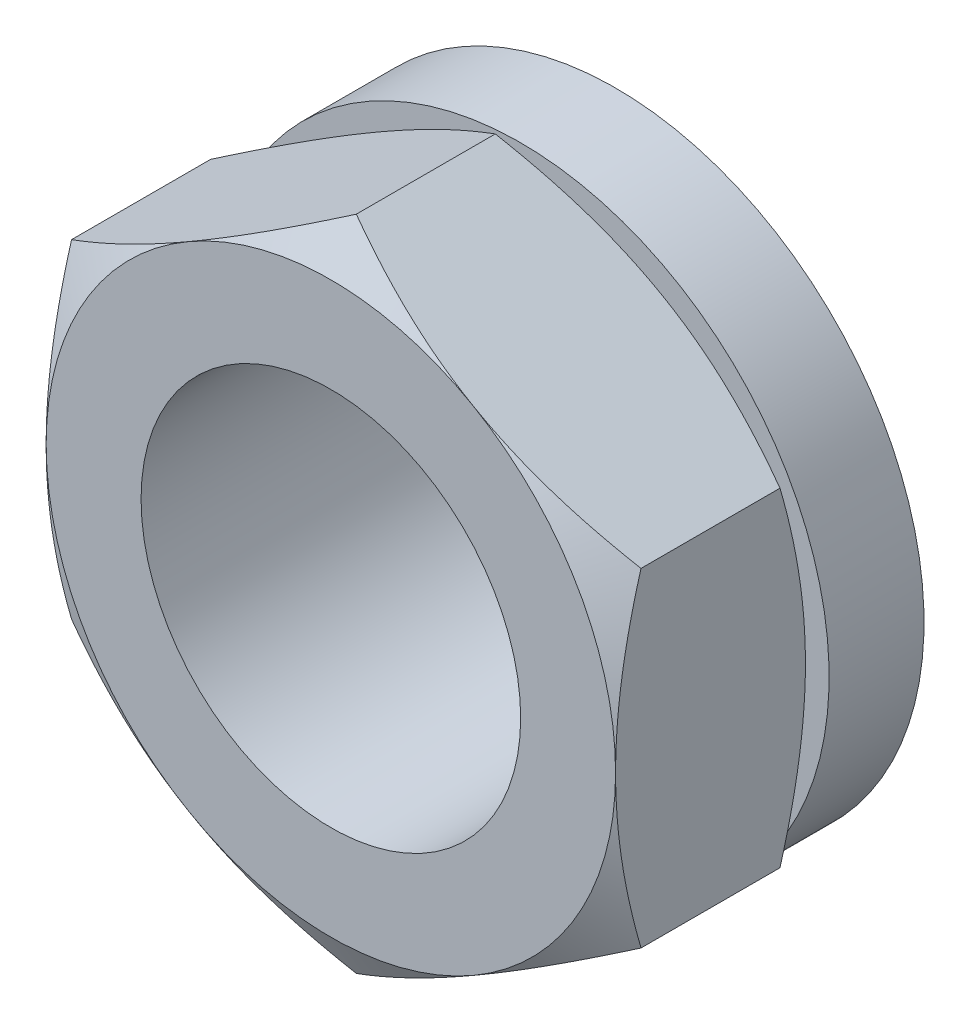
ISO-10303-21;
HEADER;
FILE_DESCRIPTION(('STEP AP214'),'2;1');
FILE_NAME('part.step','',(''),(''),'','','');
FILE_SCHEMA(('AUTOMOTIVE_DESIGN { 1 0 10303 214 1 1 1 1 }'));
ENDSEC;
DATA;
#1=APPLICATION_CONTEXT('core data for automotive mechanical design processes');
#2=APPLICATION_PROTOCOL_DEFINITION('international standard','automotive_design',2000,#1);
#3=PRODUCT_CONTEXT('',#1,'mechanical');
#4=PRODUCT('Part','Part','',(#3));
#5=PRODUCT_RELATED_PRODUCT_CATEGORY('part','',(#4));
#6=PRODUCT_DEFINITION_FORMATION('','',#4);
#7=PRODUCT_DEFINITION_CONTEXT('part definition',#1,'design');
#8=PRODUCT_DEFINITION('design','',#6,#7);
#9=PRODUCT_DEFINITION_SHAPE('','',#8);
#10=(LENGTH_UNIT() NAMED_UNIT(*) SI_UNIT(.MILLI.,.METRE.));
#11=(NAMED_UNIT(*) PLANE_ANGLE_UNIT() SI_UNIT($,.RADIAN.));
#12=(NAMED_UNIT(*) SI_UNIT($,.STERADIAN.) SOLID_ANGLE_UNIT());
#13=UNCERTAINTY_MEASURE_WITH_UNIT(LENGTH_MEASURE(1.E-05),#10,'distance_accuracy_value','');
#14=(GEOMETRIC_REPRESENTATION_CONTEXT(3) GLOBAL_UNCERTAINTY_ASSIGNED_CONTEXT((#13)) GLOBAL_UNIT_ASSIGNED_CONTEXT((#10,
#11,#12)) REPRESENTATION_CONTEXT('',''));
#15=CARTESIAN_POINT('',(0.,0.,0.));
#16=DIRECTION('',(0.,0.,1.));
#17=DIRECTION('',(1.,0.,0.));
#18=AXIS2_PLACEMENT_3D('',#15,#16,#17);
#19=CARTESIAN_POINT('',(0.,6.92820323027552,6.));
#20=DIRECTION('',(0.,0.,-1.));
#21=DIRECTION('',(-1.,0.,0.));
#22=AXIS2_PLACEMENT_3D('',#19,#20,#21);
#23=PLANE('',#22);
#24=CARTESIAN_POINT('',(0.,0.,6.));
#25=DIRECTION('',(0.,0.,1.));
#26=DIRECTION('',(1.,0.,0.));
#27=AXIS2_PLACEMENT_3D('',#24,#25,#26);
#28=CIRCLE('',#27,6.);
#29=CARTESIAN_POINT('',(-3.,5.19615242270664,6.));
#30=VERTEX_POINT('',#29);
#31=CARTESIAN_POINT('',(-6.,0.,6.));
#32=VERTEX_POINT('',#31);
#33=EDGE_CURVE('E326',#30,#32,#28,.T.);
#34=ORIENTED_EDGE('',*,*,#33,.T.);
#35=CARTESIAN_POINT('',(-3.,-5.19615242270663,6.));
#36=VERTEX_POINT('',#35);
#37=EDGE_CURVE('E327',#32,#36,#28,.T.);
#38=ORIENTED_EDGE('',*,*,#37,.T.);
#39=CARTESIAN_POINT('',(3.,-5.19615242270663,6.));
#40=VERTEX_POINT('',#39);
#41=EDGE_CURVE('E142',#36,#40,#28,.T.);
#42=ORIENTED_EDGE('',*,*,#41,.T.);
#43=CARTESIAN_POINT('',(6.,0.,6.));
#44=VERTEX_POINT('',#43);
#45=EDGE_CURVE('E140',#40,#44,#28,.T.);
#46=ORIENTED_EDGE('',*,*,#45,.T.);
#47=CARTESIAN_POINT('',(3.,5.19615242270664,6.));
#48=VERTEX_POINT('',#47);
#49=EDGE_CURVE('E144',#44,#48,#28,.T.);
#50=ORIENTED_EDGE('',*,*,#49,.T.);
#51=EDGE_CURVE('E320',#48,#30,#28,.T.);
#52=ORIENTED_EDGE('',*,*,#51,.T.);
#53=EDGE_LOOP('',(#34,#38,#42,#46,#50,#52));
#54=FACE_BOUND('',#53,.T.);
#55=CARTESIAN_POINT('',(0.,0.,6.));
#56=DIRECTION('',(0.,0.,-1.));
#57=DIRECTION('',(-1.,0.,0.));
#58=AXIS2_PLACEMENT_3D('',#55,#56,#57);
#59=CIRCLE('',#58,4.);
#60=CARTESIAN_POINT('',(-4.,0.,6.));
#61=VERTEX_POINT('',#60);
#62=EDGE_CURVE('E286',#61,#61,#59,.T.);
#63=ORIENTED_EDGE('',*,*,#62,.T.);
#64=EDGE_LOOP('',(#63));
#65=FACE_BOUND('',#64,.T.);
#66=ADVANCED_FACE('F14',(#54,#65),#23,.F.);
#67=CARTESIAN_POINT('',(-6.,3.46410161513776,2.));
#68=DIRECTION('',(0.5,-0.866025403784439,0.));
#69=DIRECTION('',(-0.866025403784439,-0.5,0.));
#70=AXIS2_PLACEMENT_3D('',#67,#68,#69);
#71=PLANE('',#70);
#72=DIRECTION('',(0.,0.,1.));
#73=VECTOR('',#72,1.);
#74=CARTESIAN_POINT('',(0.,6.92820323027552,2.));
#75=LINE('',#74,#73);
#76=CARTESIAN_POINT('',(0.,6.92820323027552,2.53589838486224));
#77=VERTEX_POINT('',#76);
#78=CARTESIAN_POINT('',(0.,6.92820323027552,5.46410161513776));
#79=VERTEX_POINT('',#78);
#80=EDGE_CURVE('E298',#77,#79,#75,.T.);
#81=ORIENTED_EDGE('',*,*,#80,.F.);
#82=CARTESIAN_POINT('',(0.000199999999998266,6.92831870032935,2.53596505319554));
#83=CARTESIAN_POINT('',(-0.131687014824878,6.85217369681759,2.49200899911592));
#84=CARTESIAN_POINT('',(-0.264065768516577,6.7757447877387,2.4500478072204));
#85=CARTESIAN_POINT('',(-0.529898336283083,6.62226628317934,2.37066457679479));
#86=CARTESIAN_POINT('',(-0.663352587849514,6.54521643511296,2.33324449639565));
#87=CARTESIAN_POINT('',(-1.06585213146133,6.31283321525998,2.22853041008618));
#88=CARTESIAN_POINT('',(-1.33648623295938,6.15658254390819,2.16897005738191));
#89=CARTESIAN_POINT('',(-1.74148524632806,5.92275625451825,2.09912821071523));
#90=CARTESIAN_POINT('',(-1.87464004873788,5.84587929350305,2.07923222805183));
#91=CARTESIAN_POINT('',(-2.14155132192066,5.69177799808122,2.04586941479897));
#92=CARTESIAN_POINT('',(-2.27530773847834,5.6145536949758,2.03240201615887));
#93=CARTESIAN_POINT('',(-2.54305288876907,5.45997096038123,2.01223959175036));
#94=CARTESIAN_POINT('',(-2.67704118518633,5.38261278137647,2.00553687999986));
#95=CARTESIAN_POINT('',(-2.94513416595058,5.22782922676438,1.99904036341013));
#96=CARTESIAN_POINT('',(-3.07923884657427,5.1504038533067,1.99924634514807));
#97=CARTESIAN_POINT('',(-3.44664501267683,4.93828180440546,2.00930718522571));
#98=CARTESIAN_POINT('',(-3.6798262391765,4.80365456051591,2.02619789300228));
#99=CARTESIAN_POINT('',(-4.14463991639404,4.53529425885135,2.07975922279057));
#100=CARTESIAN_POINT('',(-4.3762707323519,4.40156214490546,2.11644815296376));
#101=CARTESIAN_POINT('',(-4.84201989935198,4.13266173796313,2.2081601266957));
#102=CARTESIAN_POINT('',(-5.07607947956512,3.99752737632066,2.26357175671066));
#103=CARTESIAN_POINT('',(-5.54070808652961,3.72927392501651,2.38933391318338));
#104=CARTESIAN_POINT('',(-5.77128306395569,3.59615139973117,2.45965489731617));
#105=CARTESIAN_POINT('',(-6.0002,3.46398614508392,2.53596505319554));
#106=B_SPLINE_CURVE_WITH_KNOTS('',3,(#82,#83,#84,#85,#86,#87,#88,#89,#90,#91,#92,#93,#94,#95,
#96,#97,#98,#99,#100,#101,#102,#103,#104,#105),.UNSPECIFIED.,.F.,.F.,(4,2,2,2,2,2,2,2,2,2,2,4),
(0.,0.475482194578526,0.951168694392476,1.90451835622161,2.36951738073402,2.83447530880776,
3.29890435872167,3.76331906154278,4.57182194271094,5.38107376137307,6.20827406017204,
7.03385036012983),.UNSPECIFIED.);
#107=CARTESIAN_POINT('',(-3.,5.19615242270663,2.));
#108=VERTEX_POINT('',#107);
#109=EDGE_CURVE('E508',#77,#108,#106,.T.);
#110=ORIENTED_EDGE('',*,*,#109,.T.);
#111=CARTESIAN_POINT('',(-6.,3.46410161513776,2.53589838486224));
#112=VERTEX_POINT('',#111);
#113=EDGE_CURVE('E185',#108,#112,#106,.T.);
#114=ORIENTED_EDGE('',*,*,#113,.T.);
#115=DIRECTION('',(0.,0.,1.));
#116=VECTOR('',#115,1.);
#117=CARTESIAN_POINT('',(-6.,3.46410161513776,2.));
#118=LINE('',#117,#116);
#119=CARTESIAN_POINT('',(-6.,3.46410161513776,5.46410161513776));
#120=VERTEX_POINT('',#119);
#121=EDGE_CURVE('E279',#112,#120,#118,.T.);
#122=ORIENTED_EDGE('',*,*,#121,.T.);
#123=CARTESIAN_POINT('',(-6.0002,3.46398614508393,5.46403494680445));
#124=CARTESIAN_POINT('',(-5.86831298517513,3.54013114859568,5.50799100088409));
#125=CARTESIAN_POINT('',(-5.73593423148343,3.61656005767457,5.54995219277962));
#126=CARTESIAN_POINT('',(-5.47010166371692,3.77003856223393,5.62933542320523));
#127=CARTESIAN_POINT('',(-5.33664741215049,3.84708841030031,5.66675550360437));
#128=CARTESIAN_POINT('',(-4.93414786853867,4.07947163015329,5.77146958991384));
#129=CARTESIAN_POINT('',(-4.66351376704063,4.23572230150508,5.83102994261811));
#130=CARTESIAN_POINT('',(-4.25851475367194,4.46954859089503,5.90087178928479));
#131=CARTESIAN_POINT('',(-4.12535995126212,4.54642555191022,5.92076777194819));
#132=CARTESIAN_POINT('',(-3.85844867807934,4.70052684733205,5.95413058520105));
#133=CARTESIAN_POINT('',(-3.72469226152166,4.77775115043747,5.96759798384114));
#134=CARTESIAN_POINT('',(-3.45694711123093,4.93233388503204,5.98776040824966));
#135=CARTESIAN_POINT('',(-3.32295881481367,5.0096920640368,5.99446312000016));
#136=CARTESIAN_POINT('',(-3.05486583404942,5.16447561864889,6.00095963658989));
#137=CARTESIAN_POINT('',(-2.92076115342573,5.24190099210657,6.00075365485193));
#138=CARTESIAN_POINT('',(-2.55335498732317,5.45402304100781,5.99069281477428));
#139=CARTESIAN_POINT('',(-2.3201737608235,5.58865028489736,5.97380210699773));
#140=CARTESIAN_POINT('',(-1.85536008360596,5.85701058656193,5.92024077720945));
#141=CARTESIAN_POINT('',(-1.6237292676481,5.99074270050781,5.88355184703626));
#142=CARTESIAN_POINT('',(-1.15798010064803,6.25964310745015,5.79183987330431));
#143=CARTESIAN_POINT('',(-0.923920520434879,6.39477746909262,5.73642824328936));
#144=CARTESIAN_POINT('',(-0.459291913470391,6.66303092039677,5.61066608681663));
#145=CARTESIAN_POINT('',(-0.22871693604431,6.7961534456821,5.54034510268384));
#146=CARTESIAN_POINT('',(0.00019999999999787,6.92831870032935,5.46403494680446));
#147=B_SPLINE_CURVE_WITH_KNOTS('',3,(#123,#124,#125,#126,#127,#128,#129,#130,#131,#132,#133,
#134,#135,#136,#137,#138,#139,#140,#141,#142,#143,#144,#145,#146),.UNSPECIFIED.,.F.,.F.,(4,2,2,
2,2,2,2,2,2,2,2,4),(0.,0.475482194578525,0.951168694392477,1.90451835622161,2.36951738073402,
2.83447530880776,3.29890435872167,3.76331906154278,4.57182194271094,5.38107376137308,
6.20827406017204,7.03385036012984),.UNSPECIFIED.);
#148=EDGE_CURVE('E311',#120,#30,#147,.T.);
#149=ORIENTED_EDGE('',*,*,#148,.T.);
#150=EDGE_CURVE('E234',#30,#79,#147,.T.);
#151=ORIENTED_EDGE('',*,*,#150,.T.);
#152=EDGE_LOOP('',(#81,#110,#114,#122,#149,#151));
#153=FACE_BOUND('',#152,.T.);
#154=ADVANCED_FACE('F16',(#153),#71,.F.);
#155=CARTESIAN_POINT('',(0.,6.92820323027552,2.));
#156=DIRECTION('',(-0.5,-0.866025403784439,0.));
#157=DIRECTION('',(-0.866025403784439,0.5,0.));
#158=AXIS2_PLACEMENT_3D('',#155,#156,#157);
#159=PLANE('',#158);
#160=DIRECTION('',(0.,0.,1.));
#161=VECTOR('',#160,1.);
#162=CARTESIAN_POINT('',(6.,3.46410161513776,2.));
#163=LINE('',#162,#161);
#164=CARTESIAN_POINT('',(6.,3.46410161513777,2.53589838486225));
#165=VERTEX_POINT('',#164);
#166=CARTESIAN_POINT('',(6.,3.46410161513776,5.46410161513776));
#167=VERTEX_POINT('',#166);
#168=EDGE_CURVE('E297',#165,#167,#163,.T.);
#169=ORIENTED_EDGE('',*,*,#168,.F.);
#170=CARTESIAN_POINT('',(6.0002,3.46398614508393,2.53596505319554));
#171=CARTESIAN_POINT('',(5.86831298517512,3.54013114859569,2.49200899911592));
#172=CARTESIAN_POINT('',(5.73593423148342,3.61656005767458,2.4500478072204));
#173=CARTESIAN_POINT('',(5.47010166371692,3.77003856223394,2.37066457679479));
#174=CARTESIAN_POINT('',(5.33664741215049,3.84708841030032,2.33324449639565));
#175=CARTESIAN_POINT('',(4.93414786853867,4.0794716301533,2.22853041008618));
#176=CARTESIAN_POINT('',(4.66351376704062,4.23572230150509,2.16897005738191));
#177=CARTESIAN_POINT('',(4.25851475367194,4.46954859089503,2.09912821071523));
#178=CARTESIAN_POINT('',(4.12535995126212,4.54642555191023,2.07923222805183));
#179=CARTESIAN_POINT('',(3.85844867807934,4.70052684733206,2.04586941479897));
#180=CARTESIAN_POINT('',(3.72469226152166,4.77775115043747,2.03240201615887));
#181=CARTESIAN_POINT('',(3.45694711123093,4.93233388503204,2.01223959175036));
#182=CARTESIAN_POINT('',(3.32295881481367,5.00969206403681,2.00553687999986));
#183=CARTESIAN_POINT('',(3.05486583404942,5.1644756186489,1.99904036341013));
#184=CARTESIAN_POINT('',(2.92076115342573,5.24190099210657,1.99924634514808));
#185=CARTESIAN_POINT('',(2.55335498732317,5.45402304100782,2.00930718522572));
#186=CARTESIAN_POINT('',(2.3201737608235,5.58865028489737,2.02619789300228));
#187=CARTESIAN_POINT('',(1.85536008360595,5.85701058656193,2.07975922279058));
#188=CARTESIAN_POINT('',(1.6237292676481,5.99074270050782,2.11644815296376));
#189=CARTESIAN_POINT('',(1.15798010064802,6.25964310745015,2.20816012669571));
#190=CARTESIAN_POINT('',(0.923920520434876,6.39477746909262,2.26357175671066));
#191=CARTESIAN_POINT('',(0.459291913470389,6.66303092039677,2.38933391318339));
#192=CARTESIAN_POINT('',(0.228716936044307,6.79615344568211,2.45965489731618));
#193=CARTESIAN_POINT('',(-0.000200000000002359,6.92831870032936,2.53596505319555));
#194=B_SPLINE_CURVE_WITH_KNOTS('',3,(#170,#171,#172,#173,#174,#175,#176,#177,#178,#179,#180,
#181,#182,#183,#184,#185,#186,#187,#188,#189,#190,#191,#192,#193),.UNSPECIFIED.,.F.,.F.,(4,2,2,
2,2,2,2,2,2,2,2,4),(0.,0.475482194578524,0.951168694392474,1.90451835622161,2.36951738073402,
2.83447530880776,3.29890435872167,3.76331906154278,4.57182194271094,5.38107376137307,
6.20827406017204,7.03385036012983),.UNSPECIFIED.);
#195=CARTESIAN_POINT('',(3.,5.19615242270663,2.));
#196=VERTEX_POINT('',#195);
#197=EDGE_CURVE('E124',#165,#196,#194,.T.);
#198=ORIENTED_EDGE('',*,*,#197,.T.);
#199=EDGE_CURVE('E152',#196,#77,#194,.T.);
#200=ORIENTED_EDGE('',*,*,#199,.T.);
#201=ORIENTED_EDGE('',*,*,#80,.T.);
#202=CARTESIAN_POINT('',(-0.000200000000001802,6.92831870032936,5.46403494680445));
#203=CARTESIAN_POINT('',(0.131687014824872,6.8521736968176,5.50799100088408));
#204=CARTESIAN_POINT('',(0.26406576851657,6.77574478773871,5.54995219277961));
#205=CARTESIAN_POINT('',(0.529898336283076,6.62226628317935,5.62933542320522));
#206=CARTESIAN_POINT('',(0.663352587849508,6.54521643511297,5.66675550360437));
#207=CARTESIAN_POINT('',(1.06585213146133,6.31283321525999,5.77146958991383));
#208=CARTESIAN_POINT('',(1.33648623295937,6.1565825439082,5.83102994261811));
#209=CARTESIAN_POINT('',(1.74148524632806,5.92275625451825,5.90087178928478));
#210=CARTESIAN_POINT('',(1.87464004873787,5.84587929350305,5.92076777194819));
#211=CARTESIAN_POINT('',(2.14155132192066,5.69177799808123,5.95413058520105));
#212=CARTESIAN_POINT('',(2.27530773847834,5.61455369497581,5.96759798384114));
#213=CARTESIAN_POINT('',(2.54305288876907,5.45997096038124,5.98776040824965));
#214=CARTESIAN_POINT('',(2.67704118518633,5.38261278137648,5.99446312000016));
#215=CARTESIAN_POINT('',(2.94513416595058,5.22782922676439,6.00095963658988));
#216=CARTESIAN_POINT('',(3.07923884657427,5.15040385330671,6.00075365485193));
#217=CARTESIAN_POINT('',(3.44664501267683,4.93828180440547,5.99069281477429));
#218=CARTESIAN_POINT('',(3.6798262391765,4.80365456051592,5.97380210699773));
#219=CARTESIAN_POINT('',(4.14463991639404,4.53529425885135,5.92024077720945));
#220=CARTESIAN_POINT('',(4.3762707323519,4.40156214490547,5.88355184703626));
#221=CARTESIAN_POINT('',(4.84201989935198,4.13266173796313,5.79183987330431));
#222=CARTESIAN_POINT('',(5.07607947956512,3.99752737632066,5.73642824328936));
#223=CARTESIAN_POINT('',(5.54070808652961,3.72927392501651,5.61066608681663));
#224=CARTESIAN_POINT('',(5.77128306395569,3.59615139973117,5.54034510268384));
#225=CARTESIAN_POINT('',(6.0002,3.46398614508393,5.46403494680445));
#226=B_SPLINE_CURVE_WITH_KNOTS('',3,(#202,#203,#204,#205,#206,#207,#208,#209,#210,#211,#212,
#213,#214,#215,#216,#217,#218,#219,#220,#221,#222,#223,#224,#225),.UNSPECIFIED.,.F.,.F.,(4,2,2,
2,2,2,2,2,2,2,2,4),(0.,0.475482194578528,0.95116869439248,1.90451835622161,2.36951738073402,
2.83447530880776,3.29890435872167,3.76331906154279,4.57182194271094,5.38107376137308,
6.20827406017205,7.03385036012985),.UNSPECIFIED.);
#227=EDGE_CURVE('E233',#79,#48,#226,.T.);
#228=ORIENTED_EDGE('',*,*,#227,.T.);
#229=EDGE_CURVE('E226',#48,#167,#226,.T.);
#230=ORIENTED_EDGE('',*,*,#229,.T.);
#231=EDGE_LOOP('',(#169,#198,#200,#201,#228,#230));
#232=FACE_BOUND('',#231,.T.);
#233=ADVANCED_FACE('F240',(#232),#159,.F.);
#234=CARTESIAN_POINT('',(6.,3.46410161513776,2.));
#235=DIRECTION('',(-1.,0.,0.));
#236=DIRECTION('',(0.,1.,0.));
#237=AXIS2_PLACEMENT_3D('',#234,#235,#236);
#238=PLANE('',#237);
#239=DIRECTION('',(0.,0.,1.));
#240=VECTOR('',#239,1.);
#241=CARTESIAN_POINT('',(6.,-3.46410161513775,2.));
#242=LINE('',#241,#240);
#243=CARTESIAN_POINT('',(6.,-3.46410161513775,2.53589838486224));
#244=VERTEX_POINT('',#243);
#245=CARTESIAN_POINT('',(6.,-3.46410161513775,5.46410161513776));
#246=VERTEX_POINT('',#245);
#247=EDGE_CURVE('E139',#244,#246,#242,.T.);
#248=ORIENTED_EDGE('',*,*,#247,.F.);
#249=CARTESIAN_POINT('',(6.,-9.32991455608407,4.94025382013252));
#250=CARTESIAN_POINT('',(6.,-9.06765110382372,4.81293255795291));
#251=CARTESIAN_POINT('',(6.,-8.80478828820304,4.68682488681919));
#252=CARTESIAN_POINT('',(6.,-8.27754530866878,4.4377187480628));
#253=CARTESIAN_POINT('',(6.,-8.01316491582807,4.31472076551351));
#254=CARTESIAN_POINT('',(6.,-7.48121785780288,4.07190252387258));
#255=CARTESIAN_POINT('',(6.,-7.21364169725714,3.95210299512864));
#256=CARTESIAN_POINT('',(6.,-6.67636993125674,3.71737312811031));
#257=CARTESIAN_POINT('',(6.,-6.40667442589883,3.60244256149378));
#258=CARTESIAN_POINT('',(6.,-5.85592163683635,3.37509703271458));
#259=CARTESIAN_POINT('',(6.,-5.57478000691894,3.26288529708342));
#260=CARTESIAN_POINT('',(6.,-5.00921646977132,3.04689432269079));
#261=CARTESIAN_POINT('',(6.,-4.72479419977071,2.94311602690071));
#262=CARTESIAN_POINT('',(6.,-4.15274239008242,2.74669783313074));
#263=CARTESIAN_POINT('',(6.,-3.86512059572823,2.65403559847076));
#264=CARTESIAN_POINT('',(6.,-3.28574796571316,2.48280758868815));
#265=CARTESIAN_POINT('',(6.,-2.99399845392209,2.40423739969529));
#266=CARTESIAN_POINT('',(6.,-2.40785079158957,2.26536546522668));
#267=CARTESIAN_POINT('',(6.,-2.11347681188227,2.20496332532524));
#268=CARTESIAN_POINT('',(6.,-1.521000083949,2.10583480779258));
#269=CARTESIAN_POINT('',(6.,-1.22289769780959,2.06710634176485));
#270=CARTESIAN_POINT('',(6.,-0.776117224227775,2.0278394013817));
#271=CARTESIAN_POINT('',(6.,-0.628229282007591,2.01789316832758));
#272=CARTESIAN_POINT('',(6.,-0.332158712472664,2.00425958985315));
#273=CARTESIAN_POINT('',(6.,-0.183976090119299,2.00057213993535));
#274=CARTESIAN_POINT('',(6.,0.112410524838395,1.99955106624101));
#275=CARTESIAN_POINT('',(6.,0.260614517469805,2.0022174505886));
#276=CARTESIAN_POINT('',(6.,0.556778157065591,2.0138366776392));
#277=CARTESIAN_POINT('',(6.,0.704737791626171,2.02278983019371));
#278=CARTESIAN_POINT('',(6.,1.05958390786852,2.05161112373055));
#279=CARTESIAN_POINT('',(6.,1.26623652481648,2.07442094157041));
#280=CARTESIAN_POINT('',(6.,1.67801459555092,2.13106619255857));
#281=CARTESIAN_POINT('',(6.,1.88313984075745,2.16490310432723));
#282=CARTESIAN_POINT('',(6.,2.49598696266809,2.28116093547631));
#283=CARTESIAN_POINT('',(6.,2.90095259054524,2.37830800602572));
#284=CARTESIAN_POINT('',(6.,3.50649786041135,2.54685384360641));
#285=CARTESIAN_POINT('',(6.,3.71021647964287,2.60762447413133));
#286=CARTESIAN_POINT('',(6.,4.11567539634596,2.7354999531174));
#287=CARTESIAN_POINT('',(6.,4.31741568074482,2.80260484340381));
#288=CARTESIAN_POINT('',(6.,4.71898072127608,2.94207033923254));
#289=CARTESIAN_POINT('',(6.,4.91880607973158,3.01442922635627));
#290=CARTESIAN_POINT('',(6.,5.31679991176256,3.16354914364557));
#291=CARTESIAN_POINT('',(6.,5.51496840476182,3.24031012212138));
#292=CARTESIAN_POINT('',(6.,5.98253373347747,3.42644632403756));
#293=CARTESIAN_POINT('',(6.,6.25129155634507,3.53742374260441));
#294=CARTESIAN_POINT('',(6.,6.78651463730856,3.76479156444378));
#295=CARTESIAN_POINT('',(6.,7.05297975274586,3.8811823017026));
#296=CARTESIAN_POINT('',(6.,7.58403842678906,4.11829035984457));
#297=CARTESIAN_POINT('',(6.,7.84863158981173,4.23900856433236));
#298=CARTESIAN_POINT('',(6.,8.37621435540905,4.48390583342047));
#299=CARTESIAN_POINT('',(6.,8.63920392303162,4.60808497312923));
#300=CARTESIAN_POINT('',(6.,9.16411999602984,4.85938768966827));
#301=CARTESIAN_POINT('',(6.,9.42604504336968,4.98651430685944));
#302=CARTESIAN_POINT('',(6.,9.94876012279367,5.2430821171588));
#303=CARTESIAN_POINT('',(6.,10.2095501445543,5.37252333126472));
#304=CARTESIAN_POINT('',(6.,10.9904182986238,5.76366806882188));
#305=CARTESIAN_POINT('',(6.,11.5090658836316,6.02822713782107));
#306=CARTESIAN_POINT('',(6.,12.500110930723,6.5402374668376));
#307=CARTESIAN_POINT('',(6.,12.9727320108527,6.78725784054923));
#308=CARTESIAN_POINT('',(6.,13.9162080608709,7.2846869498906));
#309=CARTESIAN_POINT('',(6.,14.3870629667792,7.53509580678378));
#310=CARTESIAN_POINT('',(6.,15.3262077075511,8.0378581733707));
#311=CARTESIAN_POINT('',(6.,15.7945010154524,8.29020520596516));
#312=CARTESIAN_POINT('',(6.,16.7299582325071,8.79692276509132));
#313=CARTESIAN_POINT('',(6.,17.1971222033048,9.05129317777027));
#314=CARTESIAN_POINT('',(6.,17.663870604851,9.30641871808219));
#315=B_SPLINE_CURVE_WITH_KNOTS('',3,(#249,#250,#251,#252,#253,#254,#255,#256,#257,#258,#259,
#260,#261,#262,#263,#264,#265,#266,#267,#268,#269,#270,#271,#272,#273,#274,#275,#276,#277,#278,
#279,#280,#281,#282,#283,#284,#285,#286,#287,#288,#289,#290,#291,#292,#293,#294,#295,#296,#297,
#298,#299,#300,#301,#302,#303,#304,#305,#306,#307,#308,#309,#310,#311,#312,#313,#314),
.UNSPECIFIED.,.F.,.F.,(4,2,2,2,2,2,2,2,2,2,2,2,2,2,2,2,2,2,2,2,2,2,2,2,2,2,2,2,2,2,2,2,4),(0.,
0.874616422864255,1.7493684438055,2.62884102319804,3.50827231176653,4.41629163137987,
5.32441234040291,6.23067656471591,7.13665643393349,8.03753388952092,8.93832452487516,
9.38287831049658,9.82742467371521,10.2719716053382,10.7165404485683,11.3399117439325,
11.9633666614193,13.2109592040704,13.8486744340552,14.4863938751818,15.1239056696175,
15.7614099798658,16.6336377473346,17.5059194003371,18.3783801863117,19.2508599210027,
20.1242836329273,20.9977152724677,22.7443408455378,24.3441723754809,25.9440613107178,
27.5399253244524,29.1357001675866),.UNSPECIFIED.);
#316=CARTESIAN_POINT('',(6.,0.,2.));
#317=VERTEX_POINT('',#316);
#318=EDGE_CURVE('E128',#244,#317,#315,.T.);
#319=ORIENTED_EDGE('',*,*,#318,.T.);
#320=EDGE_CURVE('E122',#317,#165,#315,.T.);
#321=ORIENTED_EDGE('',*,*,#320,.T.);
#322=ORIENTED_EDGE('',*,*,#168,.T.);
#323=CARTESIAN_POINT('',(6.,-9.32482483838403,3.0622175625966));
#324=CARTESIAN_POINT('',(6.,-9.06260435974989,3.18949758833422));
#325=CARTESIAN_POINT('',(6.,-8.79978407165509,3.31556295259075));
#326=CARTESIAN_POINT('',(6.,-8.27262499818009,3.56458163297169));
#327=CARTESIAN_POINT('',(6.,-8.00828598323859,3.68753446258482));
#328=CARTESIAN_POINT('',(6.,-7.47641806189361,3.93025970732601));
#329=CARTESIAN_POINT('',(6.,-7.2088796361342,4.05001133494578));
#330=CARTESIAN_POINT('',(6.,-6.67168186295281,4.28464059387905));
#331=CARTESIAN_POINT('',(6.,-6.40202261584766,4.39951845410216));
#332=CARTESIAN_POINT('',(6.,-5.8513617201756,4.62674240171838));
#333=CARTESIAN_POINT('',(6.,-5.57027586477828,4.73888552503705));
#334=CARTESIAN_POINT('',(6.,-5.00482264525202,4.95473219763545));
#335=CARTESIAN_POINT('',(6.,-4.72045491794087,5.05843480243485));
#336=CARTESIAN_POINT('',(6.,-4.14851257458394,5.25469280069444));
#337=CARTESIAN_POINT('',(6.,-3.86094572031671,5.34727059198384));
#338=CARTESIAN_POINT('',(6.,-3.28168376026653,5.51832024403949));
#339=CARTESIAN_POINT('',(6.,-2.98998997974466,5.59679652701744));
#340=CARTESIAN_POINT('',(6.,-2.40395314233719,5.73547315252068));
#341=CARTESIAN_POINT('',(6.,-2.1096341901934,5.79577373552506));
#342=CARTESIAN_POINT('',(6.,-1.51727352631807,5.89469367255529));
#343=CARTESIAN_POINT('',(6.,-1.21923217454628,5.93331510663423));
#344=CARTESIAN_POINT('',(6.,-0.77254679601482,5.97242430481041));
#345=CARTESIAN_POINT('',(6.,-0.624689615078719,5.98231876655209));
#346=CARTESIAN_POINT('',(6.,-0.328682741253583,5.9958504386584));
#347=CARTESIAN_POINT('',(6.,-0.180533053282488,5.99948775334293));
#348=CARTESIAN_POINT('',(6.,0.115785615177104,6.00041139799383));
#349=CARTESIAN_POINT('',(6.,0.263954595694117,5.99769771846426));
#350=CARTESIAN_POINT('',(6.,0.560046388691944,5.98598782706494));
#351=CARTESIAN_POINT('',(6.,0.707969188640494,5.97699130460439));
#352=CARTESIAN_POINT('',(6.,1.06288029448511,5.94805889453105));
#353=CARTESIAN_POINT('',(6.,1.26963332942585,5.92517466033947));
#354=CARTESIAN_POINT('',(6.,1.68160815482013,5.86837542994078));
#355=CARTESIAN_POINT('',(6.,1.88682973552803,5.83445895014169));
#356=CARTESIAN_POINT('',(6.,2.4999614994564,5.71795919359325));
#357=CARTESIAN_POINT('',(6.,2.90511021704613,5.62064669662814));
#358=CARTESIAN_POINT('',(6.,3.51092227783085,5.45185650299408));
#359=CARTESIAN_POINT('',(6.,3.71472709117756,5.39100503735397));
#360=CARTESIAN_POINT('',(6.,4.12035746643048,5.26297013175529));
#361=CARTESIAN_POINT('',(6.,4.32218301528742,5.19578665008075));
#362=CARTESIAN_POINT('',(6.,4.72391788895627,5.05616659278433));
#363=CARTESIAN_POINT('',(6.,4.92382781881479,4.98373174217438));
#364=CARTESIAN_POINT('',(6.,5.32199080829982,4.83446235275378));
#365=CARTESIAN_POINT('',(6.,5.52024388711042,4.75762786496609));
#366=CARTESIAN_POINT('',(6.,5.98705749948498,4.57169945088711));
#367=CARTESIAN_POINT('',(6.,6.25498872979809,4.46102847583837));
#368=CARTESIAN_POINT('',(6.,6.78857384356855,4.23431062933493));
#369=CARTESIAN_POINT('',(6.,7.0542275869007,4.11826342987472));
#370=CARTESIAN_POINT('',(6.,7.58367459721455,3.88186921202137));
#371=CARTESIAN_POINT('',(6.,7.84746747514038,3.76152132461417));
#372=CARTESIAN_POINT('',(6.,8.37345862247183,3.51738373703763));
#373=CARTESIAN_POINT('',(6.,8.63565685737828,3.39359396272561));
#374=CARTESIAN_POINT('',(6.,9.15899413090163,3.14308523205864));
#375=CARTESIAN_POINT('',(6.,9.42013172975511,3.01636327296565));
#376=CARTESIAN_POINT('',(6.,9.94127713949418,2.76061500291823));
#377=CARTESIAN_POINT('',(6.,10.2012849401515,2.63158867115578));
#378=CARTESIAN_POINT('',(6.,10.9798132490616,2.24169929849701));
#379=CARTESIAN_POINT('',(6.,11.496909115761,1.97799187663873));
#380=CARTESIAN_POINT('',(6.,12.4851590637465,1.46754179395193));
#381=CARTESIAN_POINT('',(6.,12.9565351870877,1.2212270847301));
#382=CARTESIAN_POINT('',(6.,13.8975249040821,0.725215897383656));
#383=CARTESIAN_POINT('',(6.,14.367138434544,0.475519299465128));
#384=CARTESIAN_POINT('',(6.,15.3038133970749,-0.0258205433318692));
#385=CARTESIAN_POINT('',(6.,15.7708782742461,-0.277457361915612));
#386=CARTESIAN_POINT('',(6.,16.7038803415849,-0.782752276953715));
#387=CARTESIAN_POINT('',(6.,17.1698175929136,-1.03641026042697));
#388=CARTESIAN_POINT('',(6.,17.6353396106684,-1.29082288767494));
#389=B_SPLINE_CURVE_WITH_KNOTS('',3,(#323,#324,#325,#326,#327,#328,#329,#330,#331,#332,#333,
#334,#335,#336,#337,#338,#339,#340,#341,#342,#343,#344,#345,#346,#347,#348,#349,#350,#351,#352,
#353,#354,#355,#356,#357,#358,#359,#360,#361,#362,#363,#364,#365,#366,#367,#368,#369,#370,#371,
#372,#373,#374,#375,#376,#377,#378,#379,#380,#381,#382,#383,#384,#385,#386,#387,#388),
.UNSPECIFIED.,.F.,.F.,(4,2,2,2,2,2,2,2,2,2,2,2,2,2,2,2,2,2,2,2,2,2,2,2,2,2,2,2,2,2,2,2,4),(0.,
0.874446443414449,1.74902873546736,2.62833919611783,3.50760831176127,4.41539574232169,
5.32328461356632,6.22931384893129,7.13505845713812,8.03571234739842,8.93627980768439,
9.38073115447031,9.82517509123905,10.2696196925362,10.7140862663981,11.3377812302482,
11.9615601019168,13.209803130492,13.84783561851,14.4858723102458,15.1237003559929,
15.7615210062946,16.6311068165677,17.5007457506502,18.3705614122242,19.2403958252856,
20.1111643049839,20.9819406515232,22.7232586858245,24.3187995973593,25.9143971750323,
27.506006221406,29.0975269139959),.UNSPECIFIED.);
#390=EDGE_CURVE('E225',#167,#44,#389,.F.);
#391=ORIENTED_EDGE('',*,*,#390,.T.);
#392=EDGE_CURVE('E219',#44,#246,#389,.F.);
#393=ORIENTED_EDGE('',*,*,#392,.T.);
#394=EDGE_LOOP('',(#248,#319,#321,#322,#391,#393));
#395=FACE_BOUND('',#394,.T.);
#396=ADVANCED_FACE('F137',(#395),#238,.F.);
#397=CARTESIAN_POINT('',(6.,-3.46410161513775,2.));
#398=DIRECTION('',(-0.5,0.866025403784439,0.));
#399=DIRECTION('',(0.866025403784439,0.5,0.));
#400=AXIS2_PLACEMENT_3D('',#397,#398,#399);
#401=PLANE('',#400);
#402=DIRECTION('',(0.,0.,1.));
#403=VECTOR('',#402,1.);
#404=CARTESIAN_POINT('',(0.,-6.92820323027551,2.));
#405=LINE('',#404,#403);
#406=CARTESIAN_POINT('',(0.,-6.92820323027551,2.53589838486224));
#407=VERTEX_POINT('',#406);
#408=CARTESIAN_POINT('',(0.,-6.92820323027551,5.46410161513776));
#409=VERTEX_POINT('',#408);
#410=EDGE_CURVE('E288',#407,#409,#405,.T.);
#411=ORIENTED_EDGE('',*,*,#410,.F.);
#412=CARTESIAN_POINT('',(-0.000199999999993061,-6.92831870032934,2.53596505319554));
#413=CARTESIAN_POINT('',(0.131687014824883,-6.85217369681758,2.49200899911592));
#414=CARTESIAN_POINT('',(0.264065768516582,-6.77574478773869,2.45004780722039));
#415=CARTESIAN_POINT('',(0.529898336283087,-6.62226628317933,2.37066457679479));
#416=CARTESIAN_POINT('',(0.663352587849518,-6.54521643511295,2.33324449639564));
#417=CARTESIAN_POINT('',(1.06585213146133,-6.31283321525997,2.22853041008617));
#418=CARTESIAN_POINT('',(1.33648623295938,-6.15658254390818,2.1689700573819));
#419=CARTESIAN_POINT('',(1.74148524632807,-5.92275625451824,2.09912821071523));
#420=CARTESIAN_POINT('',(1.87464004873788,-5.84587929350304,2.07923222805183));
#421=CARTESIAN_POINT('',(2.14155132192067,-5.69177799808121,2.04586941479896));
#422=CARTESIAN_POINT('',(2.27530773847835,-5.6145536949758,2.03240201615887));
#423=CARTESIAN_POINT('',(2.54305288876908,-5.45997096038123,2.01223959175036));
#424=CARTESIAN_POINT('',(2.67704118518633,-5.38261278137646,2.00553687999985));
#425=CARTESIAN_POINT('',(2.94513416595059,-5.22782922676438,1.99904036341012));
#426=CARTESIAN_POINT('',(3.07923884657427,-5.1504038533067,1.99924634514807));
#427=CARTESIAN_POINT('',(3.44664501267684,-4.93828180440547,2.00930718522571));
#428=CARTESIAN_POINT('',(3.6798262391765,-4.80365456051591,2.02619789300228));
#429=CARTESIAN_POINT('',(4.14463991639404,-4.53529425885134,2.07975922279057));
#430=CARTESIAN_POINT('',(4.3762707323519,-4.40156214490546,2.11644815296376));
#431=CARTESIAN_POINT('',(4.84201989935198,-4.13266173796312,2.2081601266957));
#432=CARTESIAN_POINT('',(5.07607947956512,-3.99752737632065,2.26357175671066));
#433=CARTESIAN_POINT('',(5.54070808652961,-3.7292739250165,2.38933391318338));
#434=CARTESIAN_POINT('',(5.77128306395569,-3.59615139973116,2.45965489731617));
#435=CARTESIAN_POINT('',(6.0002,-3.46398614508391,2.53596505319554));
#436=B_SPLINE_CURVE_WITH_KNOTS('',3,(#412,#413,#414,#415,#416,#417,#418,#419,#420,#421,#422,
#423,#424,#425,#426,#427,#428,#429,#430,#431,#432,#433,#434,#435),.UNSPECIFIED.,.F.,.F.,(4,2,2,
2,2,2,2,2,2,2,2,4),(0.,0.475482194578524,0.951168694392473,1.90451835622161,2.36951738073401,
2.83447530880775,3.29890435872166,3.76331906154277,4.57182194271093,5.38107376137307,
6.20827406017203,7.03385036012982),.UNSPECIFIED.);
#437=CARTESIAN_POINT('',(3.,-5.19615242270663,2.));
#438=VERTEX_POINT('',#437);
#439=EDGE_CURVE('E190',#407,#438,#436,.T.);
#440=ORIENTED_EDGE('',*,*,#439,.T.);
#441=EDGE_CURVE('E129',#438,#244,#436,.T.);
#442=ORIENTED_EDGE('',*,*,#441,.T.);
#443=ORIENTED_EDGE('',*,*,#247,.T.);
#444=CARTESIAN_POINT('',(6.0002,-3.46398614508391,5.46403494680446));
#445=CARTESIAN_POINT('',(5.86831298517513,-3.54013114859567,5.50799100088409));
#446=CARTESIAN_POINT('',(5.73593423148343,-3.61656005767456,5.54995219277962));
#447=CARTESIAN_POINT('',(5.47010166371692,-3.77003856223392,5.62933542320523));
#448=CARTESIAN_POINT('',(5.33664741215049,-3.8470884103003,5.66675550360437));
#449=CARTESIAN_POINT('',(4.93414786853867,-4.07947163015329,5.77146958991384));
#450=CARTESIAN_POINT('',(4.66351376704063,-4.23572230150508,5.83102994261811));
#451=CARTESIAN_POINT('',(4.25851475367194,-4.46954859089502,5.90087178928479));
#452=CARTESIAN_POINT('',(4.12535995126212,-4.54642555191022,5.92076777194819));
#453=CARTESIAN_POINT('',(3.85844867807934,-4.70052684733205,5.95413058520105));
#454=CARTESIAN_POINT('',(3.72469226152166,-4.77775115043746,5.96759798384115));
#455=CARTESIAN_POINT('',(3.45694711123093,-4.93233388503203,5.98776040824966));
#456=CARTESIAN_POINT('',(3.32295881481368,-5.00969206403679,5.99446312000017));
#457=CARTESIAN_POINT('',(3.05486583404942,-5.16447561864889,6.00095963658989));
#458=CARTESIAN_POINT('',(2.92076115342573,-5.24190099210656,6.00075365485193));
#459=CARTESIAN_POINT('',(2.55335498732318,-5.45402304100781,5.99069281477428));
#460=CARTESIAN_POINT('',(2.3201737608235,-5.58865028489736,5.97380210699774));
#461=CARTESIAN_POINT('',(1.85536008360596,-5.85701058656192,5.92024077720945));
#462=CARTESIAN_POINT('',(1.6237292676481,-5.9907427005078,5.88355184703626));
#463=CARTESIAN_POINT('',(1.15798010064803,-6.25964310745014,5.79183987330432));
#464=CARTESIAN_POINT('',(0.923920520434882,-6.39477746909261,5.73642824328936));
#465=CARTESIAN_POINT('',(0.459291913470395,-6.66303092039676,5.61066608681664));
#466=CARTESIAN_POINT('',(0.228716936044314,-6.79615344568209,5.54034510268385));
#467=CARTESIAN_POINT('',(-0.000199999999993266,-6.92831870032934,5.46403494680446));
#468=B_SPLINE_CURVE_WITH_KNOTS('',3,(#444,#445,#446,#447,#448,#449,#450,#451,#452,#453,#454,
#455,#456,#457,#458,#459,#460,#461,#462,#463,#464,#465,#466,#467),.UNSPECIFIED.,.F.,.F.,(4,2,2,
2,2,2,2,2,2,2,2,4),(0.,0.475482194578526,0.951168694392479,1.90451835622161,2.36951738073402,
2.83447530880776,3.29890435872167,3.76331906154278,4.57182194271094,5.38107376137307,
6.20827406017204,7.03385036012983),.UNSPECIFIED.);
#469=EDGE_CURVE('E212',#246,#40,#468,.T.);
#470=ORIENTED_EDGE('',*,*,#469,.T.);
#471=EDGE_CURVE('E205',#40,#409,#468,.T.);
#472=ORIENTED_EDGE('',*,*,#471,.T.);
#473=EDGE_LOOP('',(#411,#440,#442,#443,#470,#472));
#474=FACE_BOUND('',#473,.T.);
#475=ADVANCED_FACE('F197',(#474),#401,.F.);
#476=CARTESIAN_POINT('',(0.,-6.92820323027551,2.));
#477=DIRECTION('',(0.5,0.866025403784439,0.));
#478=DIRECTION('',(0.866025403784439,-0.5,0.));
#479=AXIS2_PLACEMENT_3D('',#476,#477,#478);
#480=PLANE('',#479);
#481=DIRECTION('',(0.,0.,1.));
#482=VECTOR('',#481,1.);
#483=CARTESIAN_POINT('',(-6.,-3.46410161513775,2.));
#484=LINE('',#483,#482);
#485=CARTESIAN_POINT('',(-6.,-3.46410161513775,2.53589838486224));
#486=VERTEX_POINT('',#485);
#487=CARTESIAN_POINT('',(-6.,-3.46410161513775,5.46410161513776));
#488=VERTEX_POINT('',#487);
#489=EDGE_CURVE('E285',#486,#488,#484,.T.);
#490=ORIENTED_EDGE('',*,*,#489,.F.);
#491=CARTESIAN_POINT('',(-6.0002,-3.46398614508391,2.53596505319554));
#492=CARTESIAN_POINT('',(-5.86831298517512,-3.54013114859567,2.49200899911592));
#493=CARTESIAN_POINT('',(-5.73593423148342,-3.61656005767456,2.4500478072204));
#494=CARTESIAN_POINT('',(-5.47010166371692,-3.77003856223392,2.37066457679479));
#495=CARTESIAN_POINT('',(-5.33664741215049,-3.8470884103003,2.33324449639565));
#496=CARTESIAN_POINT('',(-4.93414786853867,-4.07947163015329,2.22853041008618));
#497=CARTESIAN_POINT('',(-4.66351376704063,-4.23572230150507,2.1689700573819));
#498=CARTESIAN_POINT('',(-4.25851475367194,-4.46954859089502,2.09912821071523));
#499=CARTESIAN_POINT('',(-4.12535995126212,-4.54642555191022,2.07923222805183));
#500=CARTESIAN_POINT('',(-3.85844867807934,-4.70052684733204,2.04586941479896));
#501=CARTESIAN_POINT('',(-3.72469226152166,-4.77775115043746,2.03240201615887));
#502=CARTESIAN_POINT('',(-3.45694711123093,-4.93233388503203,2.01223959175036));
#503=CARTESIAN_POINT('',(-3.32295881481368,-5.00969206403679,2.00553687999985));
#504=CARTESIAN_POINT('',(-3.05486583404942,-5.16447561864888,1.99904036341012));
#505=CARTESIAN_POINT('',(-2.92076115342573,-5.24190099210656,1.99924634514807));
#506=CARTESIAN_POINT('',(-2.55335498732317,-5.4540230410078,2.00930718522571));
#507=CARTESIAN_POINT('',(-2.3201737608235,-5.58865028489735,2.02619789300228));
#508=CARTESIAN_POINT('',(-1.85536008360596,-5.85701058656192,2.07975922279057));
#509=CARTESIAN_POINT('',(-1.6237292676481,-5.9907427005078,2.11644815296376));
#510=CARTESIAN_POINT('',(-1.15798010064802,-6.25964310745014,2.2081601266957));
#511=CARTESIAN_POINT('',(-0.923920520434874,-6.39477746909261,2.26357175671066));
#512=CARTESIAN_POINT('',(-0.459291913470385,-6.66303092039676,2.38933391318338));
#513=CARTESIAN_POINT('',(-0.228716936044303,-6.7961534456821,2.45965489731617));
#514=CARTESIAN_POINT('',(0.000200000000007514,-6.92831870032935,2.53596505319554));
#515=B_SPLINE_CURVE_WITH_KNOTS('',3,(#491,#492,#493,#494,#495,#496,#497,#498,#499,#500,#501,
#502,#503,#504,#505,#506,#507,#508,#509,#510,#511,#512,#513,#514),.UNSPECIFIED.,.F.,.F.,(4,2,2,
2,2,2,2,2,2,2,2,4),(0.,0.475482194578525,0.951168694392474,1.90451835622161,2.36951738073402,
2.83447530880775,3.29890435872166,3.76331906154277,4.57182194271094,5.38107376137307,
6.20827406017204,7.03385036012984),.UNSPECIFIED.);
#516=CARTESIAN_POINT('',(-3.,-5.19615242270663,2.));
#517=VERTEX_POINT('',#516);
#518=EDGE_CURVE('E42',#486,#517,#515,.T.);
#519=ORIENTED_EDGE('',*,*,#518,.T.);
#520=EDGE_CURVE('E196',#517,#407,#515,.T.);
#521=ORIENTED_EDGE('',*,*,#520,.T.);
#522=ORIENTED_EDGE('',*,*,#410,.T.);
#523=CARTESIAN_POINT('',(0.000200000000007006,-6.92831870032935,5.46403494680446));
#524=CARTESIAN_POINT('',(-0.131687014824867,-6.85217369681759,5.50799100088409));
#525=CARTESIAN_POINT('',(-0.264065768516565,-6.7757447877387,5.54995219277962));
#526=CARTESIAN_POINT('',(-0.52989833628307,-6.62226628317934,5.62933542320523));
#527=CARTESIAN_POINT('',(-0.663352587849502,-6.54521643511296,5.66675550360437));
#528=CARTESIAN_POINT('',(-1.06585213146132,-6.31283321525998,5.77146958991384));
#529=CARTESIAN_POINT('',(-1.33648623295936,-6.15658254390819,5.83102994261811));
#530=CARTESIAN_POINT('',(-1.74148524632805,-5.92275625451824,5.90087178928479));
#531=CARTESIAN_POINT('',(-1.87464004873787,-5.84587929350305,5.92076777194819));
#532=CARTESIAN_POINT('',(-2.14155132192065,-5.69177799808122,5.95413058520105));
#533=CARTESIAN_POINT('',(-2.27530773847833,-5.6145536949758,5.96759798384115));
#534=CARTESIAN_POINT('',(-2.54305288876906,-5.45997096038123,5.98776040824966));
#535=CARTESIAN_POINT('',(-2.67704118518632,-5.38261278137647,5.99446312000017));
#536=CARTESIAN_POINT('',(-2.94513416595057,-5.22782922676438,6.00095963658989));
#537=CARTESIAN_POINT('',(-3.07923884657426,-5.15040385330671,6.00075365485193));
#538=CARTESIAN_POINT('',(-3.44664501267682,-4.93828180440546,5.99069281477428));
#539=CARTESIAN_POINT('',(-3.67982623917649,-4.80365456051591,5.97380210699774));
#540=CARTESIAN_POINT('',(-4.14463991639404,-4.53529425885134,5.92024077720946));
#541=CARTESIAN_POINT('',(-4.3762707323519,-4.40156214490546,5.88355184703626));
#542=CARTESIAN_POINT('',(-4.84201989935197,-4.13266173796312,5.79183987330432));
#543=CARTESIAN_POINT('',(-5.07607947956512,-3.99752737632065,5.73642824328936));
#544=CARTESIAN_POINT('',(-5.54070808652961,-3.7292739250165,5.61066608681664));
#545=CARTESIAN_POINT('',(-5.77128306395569,-3.59615139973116,5.54034510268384));
#546=CARTESIAN_POINT('',(-6.0002,-3.46398614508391,5.46403494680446));
#547=B_SPLINE_CURVE_WITH_KNOTS('',3,(#523,#524,#525,#526,#527,#528,#529,#530,#531,#532,#533,
#534,#535,#536,#537,#538,#539,#540,#541,#542,#543,#544,#545,#546),.UNSPECIFIED.,.F.,.F.,(4,2,2,
2,2,2,2,2,2,2,2,4),(0.,0.475482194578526,0.951168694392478,1.90451835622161,2.36951738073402,
2.83447530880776,3.29890435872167,3.76331906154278,4.57182194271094,5.38107376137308,
6.20827406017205,7.03385036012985),.UNSPECIFIED.);
#548=EDGE_CURVE('E213',#409,#36,#547,.T.);
#549=ORIENTED_EDGE('',*,*,#548,.T.);
#550=EDGE_CURVE('E214',#36,#488,#547,.T.);
#551=ORIENTED_EDGE('',*,*,#550,.T.);
#552=EDGE_LOOP('',(#490,#519,#521,#522,#549,#551));
#553=FACE_BOUND('',#552,.T.);
#554=ADVANCED_FACE('F200',(#553),#480,.F.);
#555=CARTESIAN_POINT('',(-6.,-3.46410161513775,2.));
#556=DIRECTION('',(1.,0.,0.));
#557=DIRECTION('',(0.,-1.,0.));
#558=AXIS2_PLACEMENT_3D('',#555,#556,#557);
#559=PLANE('',#558);
#560=ORIENTED_EDGE('',*,*,#121,.F.);
#561=CARTESIAN_POINT('',(-6.,-9.32991455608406,4.94025382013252));
#562=CARTESIAN_POINT('',(-6.,-9.06765110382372,4.8129325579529));
#563=CARTESIAN_POINT('',(-6.,-8.80478828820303,4.68682488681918));
#564=CARTESIAN_POINT('',(-6.,-8.27754530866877,4.4377187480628));
#565=CARTESIAN_POINT('',(-6.,-8.01316491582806,4.31472076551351));
#566=CARTESIAN_POINT('',(-6.,-7.48121785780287,4.07190252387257));
#567=CARTESIAN_POINT('',(-6.,-7.21364169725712,3.95210299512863));
#568=CARTESIAN_POINT('',(-6.,-6.67636993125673,3.7173731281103));
#569=CARTESIAN_POINT('',(-6.,-6.40667442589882,3.60244256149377));
#570=CARTESIAN_POINT('',(-6.,-5.85592163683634,3.37509703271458));
#571=CARTESIAN_POINT('',(-6.,-5.57478000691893,3.26288529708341));
#572=CARTESIAN_POINT('',(-6.,-5.00921646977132,3.04689432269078));
#573=CARTESIAN_POINT('',(-6.,-4.7247941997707,2.94311602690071));
#574=CARTESIAN_POINT('',(-6.,-4.15274239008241,2.74669783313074));
#575=CARTESIAN_POINT('',(-6.,-3.86512059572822,2.65403559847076));
#576=CARTESIAN_POINT('',(-6.,-3.28574796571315,2.48280758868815));
#577=CARTESIAN_POINT('',(-6.,-2.99399845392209,2.40423739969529));
#578=CARTESIAN_POINT('',(-6.,-2.40785079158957,2.26536546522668));
#579=CARTESIAN_POINT('',(-6.,-2.11347681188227,2.20496332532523));
#580=CARTESIAN_POINT('',(-6.,-1.521000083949,2.10583480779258));
#581=CARTESIAN_POINT('',(-6.,-1.22289769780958,2.06710634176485));
#582=CARTESIAN_POINT('',(-6.,-0.776117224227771,2.0278394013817));
#583=CARTESIAN_POINT('',(-6.,-0.628229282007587,2.01789316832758));
#584=CARTESIAN_POINT('',(-6.,-0.33215871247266,2.00425958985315));
#585=CARTESIAN_POINT('',(-6.,-0.183976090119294,2.00057213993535));
#586=CARTESIAN_POINT('',(-6.,0.1124105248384,1.99955106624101));
#587=CARTESIAN_POINT('',(-6.,0.260614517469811,2.0022174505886));
#588=CARTESIAN_POINT('',(-6.,0.556778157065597,2.0138366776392));
#589=CARTESIAN_POINT('',(-6.,0.704737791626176,2.02278983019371));
#590=CARTESIAN_POINT('',(-6.,1.05958390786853,2.05161112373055));
#591=CARTESIAN_POINT('',(-6.,1.26623652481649,2.07442094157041));
#592=CARTESIAN_POINT('',(-6.,1.67801459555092,2.13106619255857));
#593=CARTESIAN_POINT('',(-6.,1.88313984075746,2.16490310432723));
#594=CARTESIAN_POINT('',(-6.,2.49598696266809,2.28116093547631));
#595=CARTESIAN_POINT('',(-6.,2.90095259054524,2.37830800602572));
#596=CARTESIAN_POINT('',(-6.,3.50649786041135,2.54685384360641));
#597=CARTESIAN_POINT('',(-6.,3.71021647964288,2.60762447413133));
#598=CARTESIAN_POINT('',(-6.,4.11567539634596,2.7354999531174));
#599=CARTESIAN_POINT('',(-6.,4.31741568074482,2.80260484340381));
#600=CARTESIAN_POINT('',(-6.,4.71898072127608,2.94207033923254));
#601=CARTESIAN_POINT('',(-6.,4.91880607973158,3.01442922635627));
#602=CARTESIAN_POINT('',(-6.,5.31679991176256,3.16354914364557));
#603=CARTESIAN_POINT('',(-6.,5.51496840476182,3.24031012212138));
#604=CARTESIAN_POINT('',(-6.,5.98253373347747,3.42644632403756));
#605=CARTESIAN_POINT('',(-6.,6.25129155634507,3.53742374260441));
#606=CARTESIAN_POINT('',(-6.,6.78651463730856,3.76479156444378));
#607=CARTESIAN_POINT('',(-6.,7.05297975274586,3.8811823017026));
#608=CARTESIAN_POINT('',(-6.,7.58403842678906,4.11829035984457));
#609=CARTESIAN_POINT('',(-6.,7.84863158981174,4.23900856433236));
#610=CARTESIAN_POINT('',(-6.,8.37621435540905,4.48390583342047));
#611=CARTESIAN_POINT('',(-6.,8.63920392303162,4.60808497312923));
#612=CARTESIAN_POINT('',(-6.,9.16411999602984,4.85938768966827));
#613=CARTESIAN_POINT('',(-6.,9.42604504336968,4.98651430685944));
#614=CARTESIAN_POINT('',(-6.,9.94876012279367,5.2430821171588));
#615=CARTESIAN_POINT('',(-6.,10.2095501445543,5.37252333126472));
#616=CARTESIAN_POINT('',(-6.,10.9904182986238,5.76366806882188));
#617=CARTESIAN_POINT('',(-6.,11.5090658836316,6.02822713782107));
#618=CARTESIAN_POINT('',(-6.,12.500110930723,6.5402374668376));
#619=CARTESIAN_POINT('',(-6.,12.9727320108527,6.78725784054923));
#620=CARTESIAN_POINT('',(-6.,13.9162080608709,7.28468694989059));
#621=CARTESIAN_POINT('',(-6.,14.3870629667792,7.53509580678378));
#622=CARTESIAN_POINT('',(-6.,15.3262077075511,8.0378581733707));
#623=CARTESIAN_POINT('',(-6.,15.7945010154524,8.29020520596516));
#624=CARTESIAN_POINT('',(-6.,16.7299582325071,8.79692276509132));
#625=CARTESIAN_POINT('',(-6.,17.1971222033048,9.05129317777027));
#626=CARTESIAN_POINT('',(-6.,17.663870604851,9.30641871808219));
#627=B_SPLINE_CURVE_WITH_KNOTS('',3,(#561,#562,#563,#564,#565,#566,#567,#568,#569,#570,#571,
#572,#573,#574,#575,#576,#577,#578,#579,#580,#581,#582,#583,#584,#585,#586,#587,#588,#589,#590,
#591,#592,#593,#594,#595,#596,#597,#598,#599,#600,#601,#602,#603,#604,#605,#606,#607,#608,#609,
#610,#611,#612,#613,#614,#615,#616,#617,#618,#619,#620,#621,#622,#623,#624,#625,#626),
.UNSPECIFIED.,.F.,.F.,(4,2,2,2,2,2,2,2,2,2,2,2,2,2,2,2,2,2,2,2,2,2,2,2,2,2,2,2,2,2,2,2,4),(0.,
0.874616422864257,1.7493684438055,2.62884102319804,3.50827231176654,4.41629163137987,
5.32441234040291,6.23067656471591,7.13665643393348,8.03753388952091,8.93832452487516,
9.38287831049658,9.8274246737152,10.2719716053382,10.7165404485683,11.3399117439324,
11.9633666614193,13.2109592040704,13.8486744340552,14.4863938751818,15.1239056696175,
15.7614099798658,16.6336377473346,17.5059194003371,18.3783801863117,19.2508599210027,
20.1242836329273,20.9977152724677,22.7443408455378,24.3441723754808,25.9440613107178,
27.5399253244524,29.1357001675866),.UNSPECIFIED.);
#628=CARTESIAN_POINT('',(-6.,0.,2.));
#629=VERTEX_POINT('',#628);
#630=EDGE_CURVE('E280',#112,#629,#627,.F.);
#631=ORIENTED_EDGE('',*,*,#630,.T.);
#632=EDGE_CURVE('E119',#629,#486,#627,.F.);
#633=ORIENTED_EDGE('',*,*,#632,.T.);
#634=ORIENTED_EDGE('',*,*,#489,.T.);
#635=CARTESIAN_POINT('',(-6.,-9.32482483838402,3.0622175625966));
#636=CARTESIAN_POINT('',(-6.,-9.06260435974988,3.18949758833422));
#637=CARTESIAN_POINT('',(-6.,-8.79978407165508,3.31556295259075));
#638=CARTESIAN_POINT('',(-6.,-8.27262499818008,3.5645816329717));
#639=CARTESIAN_POINT('',(-6.,-8.00828598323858,3.68753446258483));
#640=CARTESIAN_POINT('',(-6.,-7.4764180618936,3.93025970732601));
#641=CARTESIAN_POINT('',(-6.,-7.20887963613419,4.05001133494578));
#642=CARTESIAN_POINT('',(-6.,-6.67168186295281,4.28464059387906));
#643=CARTESIAN_POINT('',(-6.,-6.40202261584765,4.39951845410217));
#644=CARTESIAN_POINT('',(-6.,-5.85136172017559,4.62674240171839));
#645=CARTESIAN_POINT('',(-6.,-5.57027586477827,4.73888552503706));
#646=CARTESIAN_POINT('',(-6.,-5.00482264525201,4.95473219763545));
#647=CARTESIAN_POINT('',(-6.,-4.72045491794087,5.05843480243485));
#648=CARTESIAN_POINT('',(-6.,-4.14851257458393,5.25469280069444));
#649=CARTESIAN_POINT('',(-6.,-3.86094572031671,5.34727059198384));
#650=CARTESIAN_POINT('',(-6.,-3.28168376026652,5.5183202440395));
#651=CARTESIAN_POINT('',(-6.,-2.98998997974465,5.59679652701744));
#652=CARTESIAN_POINT('',(-6.,-2.40395314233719,5.73547315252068));
#653=CARTESIAN_POINT('',(-6.,-2.10963419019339,5.79577373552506));
#654=CARTESIAN_POINT('',(-6.,-1.51727352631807,5.89469367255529));
#655=CARTESIAN_POINT('',(-6.,-1.21923217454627,5.93331510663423));
#656=CARTESIAN_POINT('',(-6.,-0.772546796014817,5.97242430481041));
#657=CARTESIAN_POINT('',(-6.,-0.624689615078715,5.98231876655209));
#658=CARTESIAN_POINT('',(-6.,-0.328682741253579,5.9958504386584));
#659=CARTESIAN_POINT('',(-6.,-0.180533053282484,5.99948775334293));
#660=CARTESIAN_POINT('',(-6.,0.115785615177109,6.00041139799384));
#661=CARTESIAN_POINT('',(-6.,0.263954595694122,5.99769771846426));
#662=CARTESIAN_POINT('',(-6.,0.560046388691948,5.98598782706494));
#663=CARTESIAN_POINT('',(-6.,0.707969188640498,5.97699130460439));
#664=CARTESIAN_POINT('',(-6.,1.06288029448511,5.94805889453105));
#665=CARTESIAN_POINT('',(-6.,1.26963332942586,5.92517466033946));
#666=CARTESIAN_POINT('',(-6.,1.68160815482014,5.86837542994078));
#667=CARTESIAN_POINT('',(-6.,1.88682973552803,5.83445895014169));
#668=CARTESIAN_POINT('',(-6.,2.4999614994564,5.71795919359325));
#669=CARTESIAN_POINT('',(-6.,2.90511021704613,5.62064669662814));
#670=CARTESIAN_POINT('',(-6.,3.51092227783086,5.45185650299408));
#671=CARTESIAN_POINT('',(-6.,3.71472709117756,5.39100503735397));
#672=CARTESIAN_POINT('',(-6.,4.12035746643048,5.26297013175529));
#673=CARTESIAN_POINT('',(-6.,4.32218301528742,5.19578665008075));
#674=CARTESIAN_POINT('',(-6.,4.72391788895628,5.05616659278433));
#675=CARTESIAN_POINT('',(-6.,4.9238278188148,4.98373174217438));
#676=CARTESIAN_POINT('',(-6.,5.32199080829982,4.83446235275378));
#677=CARTESIAN_POINT('',(-6.,5.52024388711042,4.75762786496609));
#678=CARTESIAN_POINT('',(-6.,5.98705749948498,4.57169945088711));
#679=CARTESIAN_POINT('',(-6.,6.25498872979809,4.46102847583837));
#680=CARTESIAN_POINT('',(-6.,6.78857384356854,4.23431062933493));
#681=CARTESIAN_POINT('',(-6.,7.05422758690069,4.11826342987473));
#682=CARTESIAN_POINT('',(-6.,7.58367459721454,3.88186921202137));
#683=CARTESIAN_POINT('',(-6.,7.84746747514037,3.76152132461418));
#684=CARTESIAN_POINT('',(-6.,8.37345862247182,3.51738373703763));
#685=CARTESIAN_POINT('',(-6.,8.63565685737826,3.39359396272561));
#686=CARTESIAN_POINT('',(-6.,9.15899413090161,3.14308523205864));
#687=CARTESIAN_POINT('',(-6.,9.42013172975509,3.01636327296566));
#688=CARTESIAN_POINT('',(-6.,9.94127713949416,2.76061500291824));
#689=CARTESIAN_POINT('',(-6.,10.2012849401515,2.63158867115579));
#690=CARTESIAN_POINT('',(-6.,10.9798132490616,2.24169929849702));
#691=CARTESIAN_POINT('',(-6.,11.496909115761,1.97799187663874));
#692=CARTESIAN_POINT('',(-6.,12.4851590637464,1.46754179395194));
#693=CARTESIAN_POINT('',(-6.,12.9565351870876,1.22122708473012));
#694=CARTESIAN_POINT('',(-6.,13.8975249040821,0.725215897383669));
#695=CARTESIAN_POINT('',(-6.,14.367138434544,0.47551929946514));
#696=CARTESIAN_POINT('',(-6.,15.3038133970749,-0.0258205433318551));
#697=CARTESIAN_POINT('',(-6.,15.770878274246,-0.277457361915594));
#698=CARTESIAN_POINT('',(-6.,16.7038803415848,-0.782752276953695));
#699=CARTESIAN_POINT('',(-6.,17.1698175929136,-1.03641026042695));
#700=CARTESIAN_POINT('',(-6.,17.6353396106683,-1.29082288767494));
#701=B_SPLINE_CURVE_WITH_KNOTS('',3,(#635,#636,#637,#638,#639,#640,#641,#642,#643,#644,#645,
#646,#647,#648,#649,#650,#651,#652,#653,#654,#655,#656,#657,#658,#659,#660,#661,#662,#663,#664,
#665,#666,#667,#668,#669,#670,#671,#672,#673,#674,#675,#676,#677,#678,#679,#680,#681,#682,#683,
#684,#685,#686,#687,#688,#689,#690,#691,#692,#693,#694,#695,#696,#697,#698,#699,#700),
.UNSPECIFIED.,.F.,.F.,(4,2,2,2,2,2,2,2,2,2,2,2,2,2,2,2,2,2,2,2,2,2,2,2,2,2,2,2,2,2,2,2,4),(0.,
0.874446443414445,1.74902873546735,2.62833919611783,3.50760831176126,4.41539574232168,
5.32328461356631,6.22931384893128,7.13505845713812,8.03571234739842,8.93627980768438,
9.3807311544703,9.82517509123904,10.2696196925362,10.7140862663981,11.3377812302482,
11.9615601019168,13.209803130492,13.84783561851,14.4858723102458,15.1237003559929,
15.7615210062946,16.6311068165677,17.5007457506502,18.3705614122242,19.2403958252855,
20.1111643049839,20.9819406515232,22.7232586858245,24.3187995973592,25.9143971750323,
27.506006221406,29.0975269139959),.UNSPECIFIED.);
#702=EDGE_CURVE('E9',#488,#32,#701,.T.);
#703=ORIENTED_EDGE('',*,*,#702,.T.);
#704=EDGE_CURVE('E19',#32,#120,#701,.T.);
#705=ORIENTED_EDGE('',*,*,#704,.T.);
#706=EDGE_LOOP('',(#560,#631,#633,#634,#703,#705));
#707=FACE_BOUND('',#706,.T.);
#708=ADVANCED_FACE('F263',(#707),#559,.F.);
#709=CARTESIAN_POINT('',(0.,0.,2.));
#710=DIRECTION('',(0.,0.,1.));
#711=DIRECTION('',(1.,0.,0.));
#712=AXIS2_PLACEMENT_3D('',#709,#710,#711);
#713=CYLINDRICAL_SURFACE('',#712,4.);
#714=ORIENTED_EDGE('',*,*,#62,.F.);
#715=EDGE_LOOP('',(#714));
#716=FACE_BOUND('',#715,.T.);
#717=CARTESIAN_POINT('',(0.,0.,0.));
#718=DIRECTION('',(0.,0.,1.));
#719=DIRECTION('',(1.,0.,0.));
#720=AXIS2_PLACEMENT_3D('',#717,#718,#719);
#721=CIRCLE('',#720,4.);
#722=CARTESIAN_POINT('',(4.,0.,0.));
#723=VERTEX_POINT('',#722);
#724=EDGE_CURVE('E309',#723,#723,#721,.T.);
#725=ORIENTED_EDGE('',*,*,#724,.F.);
#726=EDGE_LOOP('',(#725));
#727=FACE_BOUND('',#726,.T.);
#728=ADVANCED_FACE('F261',(#716,#727),#713,.F.);
#729=CARTESIAN_POINT('',(0.,0.,0.));
#730=DIRECTION('',(0.,0.,-1.));
#731=DIRECTION('',(-1.,0.,0.));
#732=AXIS2_PLACEMENT_3D('',#729,#730,#731);
#733=PLANE('',#732);
#734=ORIENTED_EDGE('',*,*,#724,.T.);
#735=EDGE_LOOP('',(#734));
#736=FACE_BOUND('',#735,.T.);
#737=CARTESIAN_POINT('',(0.,0.,0.));
#738=DIRECTION('',(0.,0.,-1.));
#739=DIRECTION('',(-1.,0.,0.));
#740=AXIS2_PLACEMENT_3D('',#737,#738,#739);
#741=CIRCLE('',#740,6.5);
#742=CARTESIAN_POINT('',(-6.5,0.,0.));
#743=VERTEX_POINT('',#742);
#744=EDGE_CURVE('E291',#743,#743,#741,.T.);
#745=ORIENTED_EDGE('',*,*,#744,.T.);
#746=EDGE_LOOP('',(#745));
#747=FACE_BOUND('',#746,.T.);
#748=ADVANCED_FACE('F273',(#736,#747),#733,.T.);
#749=CARTESIAN_POINT('',(0.,0.,0.));
#750=DIRECTION('',(0.,0.,1.));
#751=DIRECTION('',(1.,0.,0.));
#752=AXIS2_PLACEMENT_3D('',#749,#750,#751);
#753=CYLINDRICAL_SURFACE('',#752,6.5);
#754=ORIENTED_EDGE('',*,*,#744,.F.);
#755=EDGE_LOOP('',(#754));
#756=FACE_BOUND('',#755,.T.);
#757=CARTESIAN_POINT('',(0.,0.,2.));
#758=DIRECTION('',(0.,0.,-1.));
#759=DIRECTION('',(-1.,0.,0.));
#760=AXIS2_PLACEMENT_3D('',#757,#758,#759);
#761=CIRCLE('',#760,6.5);
#762=CARTESIAN_POINT('',(-6.5,0.,2.));
#763=VERTEX_POINT('',#762);
#764=EDGE_CURVE('E299',#763,#763,#761,.T.);
#765=ORIENTED_EDGE('',*,*,#764,.T.);
#766=EDGE_LOOP('',(#765));
#767=FACE_BOUND('',#766,.T.);
#768=ADVANCED_FACE('F373',(#756,#767),#753,.T.);
#769=CARTESIAN_POINT('',(0.,0.,2.));
#770=DIRECTION('',(0.,0.,-1.));
#771=DIRECTION('',(-1.,0.,0.));
#772=AXIS2_PLACEMENT_3D('',#769,#770,#771);
#773=PLANE('',#772);
#774=CARTESIAN_POINT('',(0.,0.,2.));
#775=DIRECTION('',(0.,0.,1.));
#776=DIRECTION('',(1.,0.,0.));
#777=AXIS2_PLACEMENT_3D('',#774,#775,#776);
#778=CIRCLE('',#777,6.);
#779=EDGE_CURVE('E510',#108,#629,#778,.T.);
#780=ORIENTED_EDGE('',*,*,#779,.F.);
#781=EDGE_CURVE('E115',#196,#108,#778,.T.);
#782=ORIENTED_EDGE('',*,*,#781,.F.);
#783=EDGE_CURVE('E107',#317,#196,#778,.T.);
#784=ORIENTED_EDGE('',*,*,#783,.F.);
#785=EDGE_CURVE('E112',#438,#317,#778,.T.);
#786=ORIENTED_EDGE('',*,*,#785,.F.);
#787=EDGE_CURVE('E135',#517,#438,#778,.T.);
#788=ORIENTED_EDGE('',*,*,#787,.F.);
#789=EDGE_CURVE('E36',#629,#517,#778,.T.);
#790=ORIENTED_EDGE('',*,*,#789,.F.);
#791=EDGE_LOOP('',(#780,#782,#784,#786,#788,#790));
#792=FACE_BOUND('',#791,.T.);
#793=ORIENTED_EDGE('',*,*,#764,.F.);
#794=EDGE_LOOP('',(#793));
#795=FACE_BOUND('',#794,.T.);
#796=ADVANCED_FACE('F109',(#792,#795),#773,.F.);
#797=CARTESIAN_POINT('',(0.,0.,4.47774232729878));
#798=DIRECTION('',(0.,0.,-1.));
#799=DIRECTION('',(-1.,0.,0.));
#800=AXIS2_PLACEMENT_3D('',#797,#798,#799);
#801=CONICAL_SURFACE('',#800,8.63662763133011,1.0471975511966);
#802=ORIENTED_EDGE('',*,*,#704,.F.);
#803=ORIENTED_EDGE('',*,*,#33,.F.);
#804=ORIENTED_EDGE('',*,*,#148,.F.);
#805=EDGE_LOOP('',(#802,#803,#804));
#806=FACE_BOUND('',#805,.T.);
#807=ADVANCED_FACE('F165',(#806),#801,.T.);
#808=ORIENTED_EDGE('',*,*,#37,.F.);
#809=ORIENTED_EDGE('',*,*,#702,.F.);
#810=ORIENTED_EDGE('',*,*,#550,.F.);
#811=EDGE_LOOP('',(#808,#809,#810));
#812=FACE_BOUND('',#811,.T.);
#813=ADVANCED_FACE('F339',(#812),#801,.T.);
#814=ORIENTED_EDGE('',*,*,#41,.F.);
#815=ORIENTED_EDGE('',*,*,#548,.F.);
#816=ORIENTED_EDGE('',*,*,#471,.F.);
#817=EDGE_LOOP('',(#814,#815,#816));
#818=FACE_BOUND('',#817,.T.);
#819=ADVANCED_FACE('F334',(#818),#801,.T.);
#820=ORIENTED_EDGE('',*,*,#45,.F.);
#821=ORIENTED_EDGE('',*,*,#469,.F.);
#822=ORIENTED_EDGE('',*,*,#392,.F.);
#823=EDGE_LOOP('',(#820,#821,#822));
#824=FACE_BOUND('',#823,.T.);
#825=ADVANCED_FACE('F346',(#824),#801,.T.);
#826=ORIENTED_EDGE('',*,*,#49,.F.);
#827=ORIENTED_EDGE('',*,*,#390,.F.);
#828=ORIENTED_EDGE('',*,*,#229,.F.);
#829=EDGE_LOOP('',(#826,#827,#828));
#830=FACE_BOUND('',#829,.T.);
#831=ADVANCED_FACE('F348',(#830),#801,.T.);
#832=ORIENTED_EDGE('',*,*,#51,.F.);
#833=ORIENTED_EDGE('',*,*,#227,.F.);
#834=ORIENTED_EDGE('',*,*,#150,.F.);
#835=EDGE_LOOP('',(#832,#833,#834));
#836=FACE_BOUND('',#835,.T.);
#837=ADVANCED_FACE('F350',(#836),#801,.T.);
#838=CARTESIAN_POINT('',(0.,0.,2.));
#839=DIRECTION('',(0.,0.,1.));
#840=DIRECTION('',(1.,0.,0.));
#841=AXIS2_PLACEMENT_3D('',#838,#839,#840);
#842=CONICAL_SURFACE('',#841,6.,1.0471975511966);
#843=ORIENTED_EDGE('',*,*,#632,.F.);
#844=ORIENTED_EDGE('',*,*,#789,.T.);
#845=ORIENTED_EDGE('',*,*,#518,.F.);
#846=EDGE_LOOP('',(#843,#844,#845));
#847=FACE_BOUND('',#846,.T.);
#848=ADVANCED_FACE('F164',(#847),#842,.T.);
#849=ORIENTED_EDGE('',*,*,#520,.F.);
#850=ORIENTED_EDGE('',*,*,#787,.T.);
#851=ORIENTED_EDGE('',*,*,#439,.F.);
#852=EDGE_LOOP('',(#849,#850,#851));
#853=FACE_BOUND('',#852,.T.);
#854=ADVANCED_FACE('F163',(#853),#842,.T.);
#855=ORIENTED_EDGE('',*,*,#441,.F.);
#856=ORIENTED_EDGE('',*,*,#785,.T.);
#857=ORIENTED_EDGE('',*,*,#318,.F.);
#858=EDGE_LOOP('',(#855,#856,#857));
#859=FACE_BOUND('',#858,.T.);
#860=ADVANCED_FACE('F132',(#859),#842,.T.);
#861=ORIENTED_EDGE('',*,*,#783,.T.);
#862=ORIENTED_EDGE('',*,*,#197,.F.);
#863=ORIENTED_EDGE('',*,*,#320,.F.);
#864=EDGE_LOOP('',(#861,#862,#863));
#865=FACE_BOUND('',#864,.T.);
#866=ADVANCED_FACE('F123',(#865),#842,.T.);
#867=ORIENTED_EDGE('',*,*,#781,.T.);
#868=ORIENTED_EDGE('',*,*,#109,.F.);
#869=ORIENTED_EDGE('',*,*,#199,.F.);
#870=EDGE_LOOP('',(#867,#868,#869));
#871=FACE_BOUND('',#870,.T.);
#872=ADVANCED_FACE('F482',(#871),#842,.T.);
#873=ORIENTED_EDGE('',*,*,#779,.T.);
#874=ORIENTED_EDGE('',*,*,#630,.F.);
#875=ORIENTED_EDGE('',*,*,#113,.F.);
#876=EDGE_LOOP('',(#873,#874,#875));
#877=FACE_BOUND('',#876,.T.);
#878=ADVANCED_FACE('F488',(#877),#842,.T.);
#879=CLOSED_SHELL('',(#66,#154,#233,#396,#475,#554,#708,#728,#748,#768,#796,#807,#813,#819,#825,
#831,#837,#848,#854,#860,#866,#872,#878));
#880=MANIFOLD_SOLID_BREP('B1',#879);
#881=ADVANCED_BREP_SHAPE_REPRESENTATION('',(#18,#880),#14);
#882=SHAPE_DEFINITION_REPRESENTATION(#9,#881);
ENDSEC;
END-ISO-10303-21;
